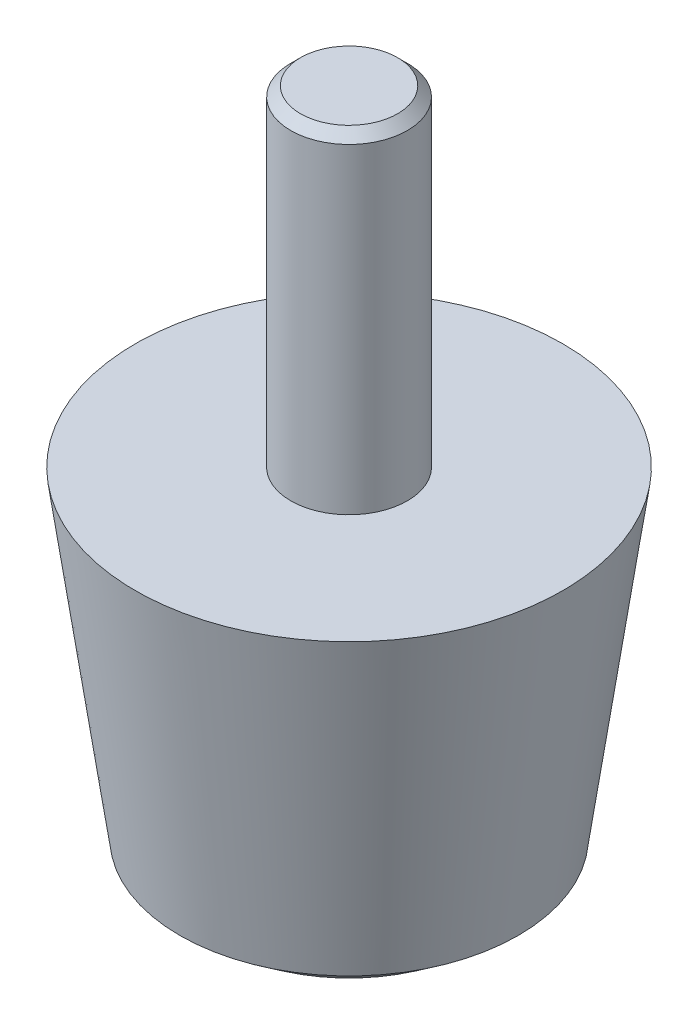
ISO-10303-21;
HEADER;
FILE_DESCRIPTION(('STEP AP214'),'2;1');
FILE_NAME('part.step','',(''),(''),'','','');
FILE_SCHEMA(('AUTOMOTIVE_DESIGN { 1 0 10303 214 1 1 1 1 }'));
ENDSEC;
DATA;
#1=APPLICATION_CONTEXT('core data for automotive mechanical design processes');
#2=APPLICATION_PROTOCOL_DEFINITION('international standard','automotive_design',2000,#1);
#3=PRODUCT_CONTEXT('',#1,'mechanical');
#4=PRODUCT('Part','Part','',(#3));
#5=PRODUCT_RELATED_PRODUCT_CATEGORY('part','',(#4));
#6=PRODUCT_DEFINITION_FORMATION('','',#4);
#7=PRODUCT_DEFINITION_CONTEXT('part definition',#1,'design');
#8=PRODUCT_DEFINITION('design','',#6,#7);
#9=PRODUCT_DEFINITION_SHAPE('','',#8);
#10=(LENGTH_UNIT() NAMED_UNIT(*) SI_UNIT(.MILLI.,.METRE.));
#11=(NAMED_UNIT(*) PLANE_ANGLE_UNIT() SI_UNIT($,.RADIAN.));
#12=(NAMED_UNIT(*) SI_UNIT($,.STERADIAN.) SOLID_ANGLE_UNIT());
#13=UNCERTAINTY_MEASURE_WITH_UNIT(LENGTH_MEASURE(1.E-05),#10,'distance_accuracy_value','');
#14=(GEOMETRIC_REPRESENTATION_CONTEXT(3) GLOBAL_UNCERTAINTY_ASSIGNED_CONTEXT((#13)) GLOBAL_UNIT_ASSIGNED_CONTEXT((#10,
#11,#12)) REPRESENTATION_CONTEXT('',''));
#15=CARTESIAN_POINT('',(0.,0.,0.));
#16=DIRECTION('',(0.,0.,1.));
#17=DIRECTION('',(1.,0.,0.));
#18=AXIS2_PLACEMENT_3D('',#15,#16,#17);
#19=CARTESIAN_POINT('',(0.,18.,0.));
#20=DIRECTION('',(0.,1.,0.));
#21=DIRECTION('',(0.,0.,1.));
#22=AXIS2_PLACEMENT_3D('',#19,#20,#21);
#23=PLANE('',#22);
#24=CARTESIAN_POINT('',(0.,18.,0.));
#25=DIRECTION('',(0.,-1.,0.));
#26=DIRECTION('',(0.,0.,-1.));
#27=AXIS2_PLACEMENT_3D('',#24,#25,#26);
#28=CIRCLE('',#27,11.);
#29=CARTESIAN_POINT('',(0.,18.,-11.));
#30=VERTEX_POINT('',#29);
#31=EDGE_CURVE('E54',#30,#30,#28,.T.);
#32=ORIENTED_EDGE('',*,*,#31,.F.);
#33=EDGE_LOOP('',(#32));
#34=FACE_BOUND('',#33,.T.);
#35=CARTESIAN_POINT('',(0.,18.,0.));
#36=DIRECTION('',(0.,1.,0.));
#37=DIRECTION('',(0.,0.,1.));
#38=AXIS2_PLACEMENT_3D('',#35,#36,#37);
#39=CIRCLE('',#38,3.);
#40=CARTESIAN_POINT('',(0.,18.,3.));
#41=VERTEX_POINT('',#40);
#42=EDGE_CURVE('E57',#41,#41,#39,.T.);
#43=ORIENTED_EDGE('',*,*,#42,.F.);
#44=EDGE_LOOP('',(#43));
#45=FACE_BOUND('',#44,.T.);
#46=ADVANCED_FACE('F34',(#34,#45),#23,.T.);
#47=CARTESIAN_POINT('',(8.5,0.,0.));
#48=DIRECTION('',(0.,-1.,0.));
#49=DIRECTION('',(0.,0.,-1.));
#50=AXIS2_PLACEMENT_3D('',#47,#48,#49);
#51=PLANE('',#50);
#52=CARTESIAN_POINT('',(0.,0.,0.));
#53=DIRECTION('',(0.,-1.,0.));
#54=DIRECTION('',(0.,0.,-1.));
#55=AXIS2_PLACEMENT_3D('',#52,#53,#54);
#56=CIRCLE('',#55,6.74134369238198);
#57=CARTESIAN_POINT('',(0.,0.,-6.74134369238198));
#58=VERTEX_POINT('',#57);
#59=EDGE_CURVE('E49',#58,#58,#56,.T.);
#60=ORIENTED_EDGE('',*,*,#59,.T.);
#61=EDGE_LOOP('',(#60));
#62=FACE_BOUND('',#61,.T.);
#63=ADVANCED_FACE('F64',(#62),#51,.T.);
#64=CARTESIAN_POINT('',(0.,0.,0.));
#65=DIRECTION('',(0.,1.,0.));
#66=DIRECTION('',(0.,0.,1.));
#67=AXIS2_PLACEMENT_3D('',#64,#65,#66);
#68=CONICAL_SURFACE('',#67,8.5,0.138006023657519);
#69=CARTESIAN_POINT('',(0.,1.48573840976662,0.));
#70=DIRECTION('',(0.,-1.,0.));
#71=DIRECTION('',(0.,0.,-1.));
#72=AXIS2_PLACEMENT_3D('',#69,#70,#71);
#73=CIRCLE('',#72,8.70635255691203);
#74=CARTESIAN_POINT('',(0.,1.48573840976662,-8.70635255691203));
#75=VERTEX_POINT('',#74);
#76=EDGE_CURVE('E45',#75,#75,#73,.F.);
#77=ORIENTED_EDGE('',*,*,#76,.T.);
#78=EDGE_LOOP('',(#77));
#79=FACE_BOUND('',#78,.T.);
#80=ORIENTED_EDGE('',*,*,#31,.T.);
#81=EDGE_LOOP('',(#80));
#82=FACE_BOUND('',#81,.T.);
#83=ADVANCED_FACE('F70',(#79,#82),#68,.T.);
#84=CARTESIAN_POINT('',(0.,0.,0.));
#85=DIRECTION('',(0.,1.,0.));
#86=DIRECTION('',(0.,0.,1.));
#87=AXIS2_PLACEMENT_3D('',#84,#85,#86);
#88=CONICAL_SURFACE('',#87,6.74134369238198,0.923404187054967);
#89=ORIENTED_EDGE('',*,*,#76,.F.);
#90=EDGE_LOOP('',(#89));
#91=FACE_BOUND('',#90,.T.);
#92=ORIENTED_EDGE('',*,*,#59,.F.);
#93=EDGE_LOOP('',(#92));
#94=FACE_BOUND('',#93,.T.);
#95=ADVANCED_FACE('F76',(#91,#94),#88,.T.);
#96=CARTESIAN_POINT('',(0.,35.,0.));
#97=DIRECTION('',(0.,-1.,0.));
#98=DIRECTION('',(0.,0.,-1.));
#99=AXIS2_PLACEMENT_3D('',#96,#97,#98);
#100=CYLINDRICAL_SURFACE('',#99,3.);
#101=CARTESIAN_POINT('',(0.,34.5,0.));
#102=DIRECTION('',(0.,1.,0.));
#103=DIRECTION('',(0.,0.,1.));
#104=AXIS2_PLACEMENT_3D('',#101,#102,#103);
#105=CIRCLE('',#104,3.);
#106=CARTESIAN_POINT('',(0.,34.5,3.));
#107=VERTEX_POINT('',#106);
#108=EDGE_CURVE('E10',#107,#107,#105,.F.);
#109=ORIENTED_EDGE('',*,*,#108,.T.);
#110=EDGE_LOOP('',(#109));
#111=FACE_BOUND('',#110,.T.);
#112=ORIENTED_EDGE('',*,*,#42,.T.);
#113=EDGE_LOOP('',(#112));
#114=FACE_BOUND('',#113,.T.);
#115=ADVANCED_FACE('F61',(#111,#114),#100,.T.);
#116=CARTESIAN_POINT('',(0.,35.,0.));
#117=DIRECTION('',(0.,1.,0.));
#118=DIRECTION('',(0.,0.,1.));
#119=AXIS2_PLACEMENT_3D('',#116,#117,#118);
#120=PLANE('',#119);
#121=CARTESIAN_POINT('',(0.,35.,0.));
#122=DIRECTION('',(0.,1.,0.));
#123=DIRECTION('',(0.,0.,1.));
#124=AXIS2_PLACEMENT_3D('',#121,#122,#123);
#125=CIRCLE('',#124,2.5);
#126=CARTESIAN_POINT('',(0.,35.,2.5));
#127=VERTEX_POINT('',#126);
#128=EDGE_CURVE('E41',#127,#127,#125,.T.);
#129=ORIENTED_EDGE('',*,*,#128,.T.);
#130=EDGE_LOOP('',(#129));
#131=FACE_BOUND('',#130,.T.);
#132=ADVANCED_FACE('F83',(#131),#120,.T.);
#133=CARTESIAN_POINT('',(0.,35.,0.));
#134=DIRECTION('',(0.,-1.,0.));
#135=DIRECTION('',(0.,0.,-1.));
#136=AXIS2_PLACEMENT_3D('',#133,#134,#135);
#137=CONICAL_SURFACE('',#136,2.5,0.785398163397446);
#138=ORIENTED_EDGE('',*,*,#108,.F.);
#139=EDGE_LOOP('',(#138));
#140=FACE_BOUND('',#139,.T.);
#141=ORIENTED_EDGE('',*,*,#128,.F.);
#142=EDGE_LOOP('',(#141));
#143=FACE_BOUND('',#142,.T.);
#144=ADVANCED_FACE('F36',(#140,#143),#137,.T.);
#145=CLOSED_SHELL('',(#46,#63,#83,#95,#115,#132,#144));
#146=MANIFOLD_SOLID_BREP('B2',#145);
#147=ADVANCED_BREP_SHAPE_REPRESENTATION('',(#18,#146),#14);
#148=SHAPE_DEFINITION_REPRESENTATION(#9,#147);
ENDSEC;
END-ISO-10303-21;
